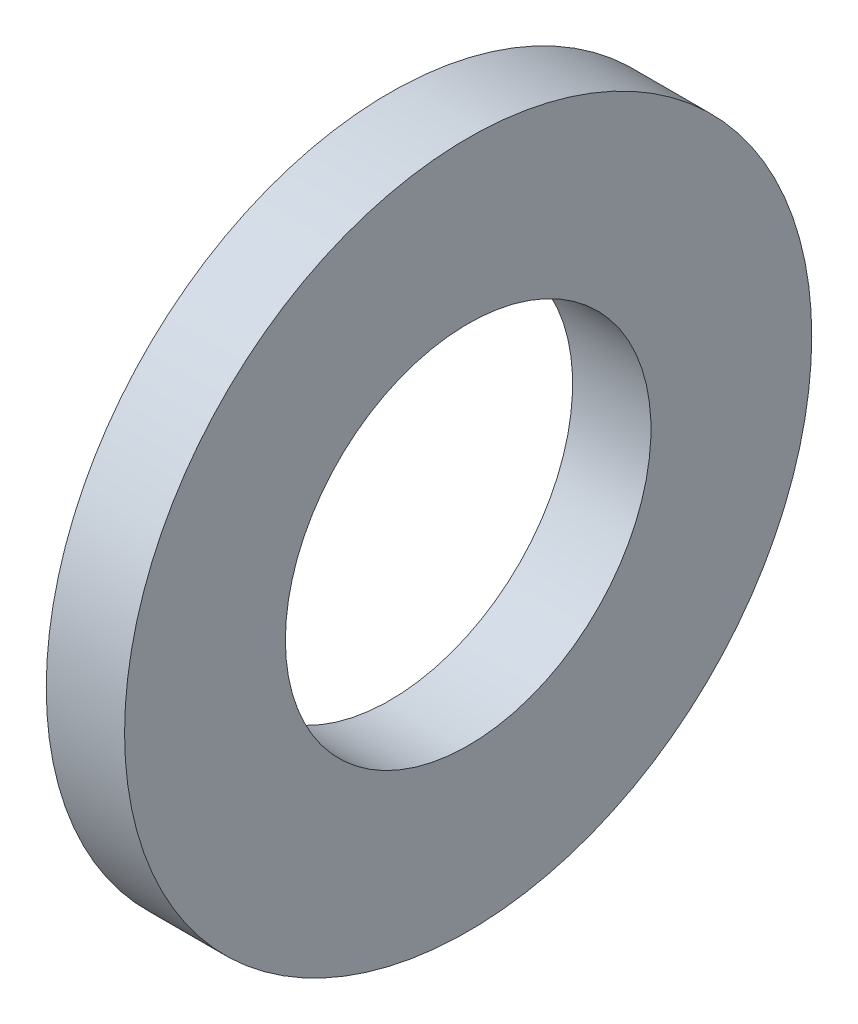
from build123d import *

# Parameters (mm, degrees)
SKETCH1_R           = 6.35
SKETCH1_R_2         = 3.3782
BOSS_EXTRUDE1_DEPTH = 1.4478


with BuildPart() as part:
    # Sketch1 → Boss-Extrude1 (new body)
    with BuildSketch(Plane(origin=(0, 0, 0), x_dir=(0, 0, -1), z_dir=(1, 0, 0))):
        with Locations(Location((0, 0, 0), (0, 0, 180))):
            Circle(SKETCH1_R)
        with Locations(Location((0, 0, 0), (0, 0, 180))):
            Circle(SKETCH1_R_2, mode=Mode.SUBTRACT)
    extrude(amount=BOSS_EXTRUDE1_DEPTH)


solid = part.part
